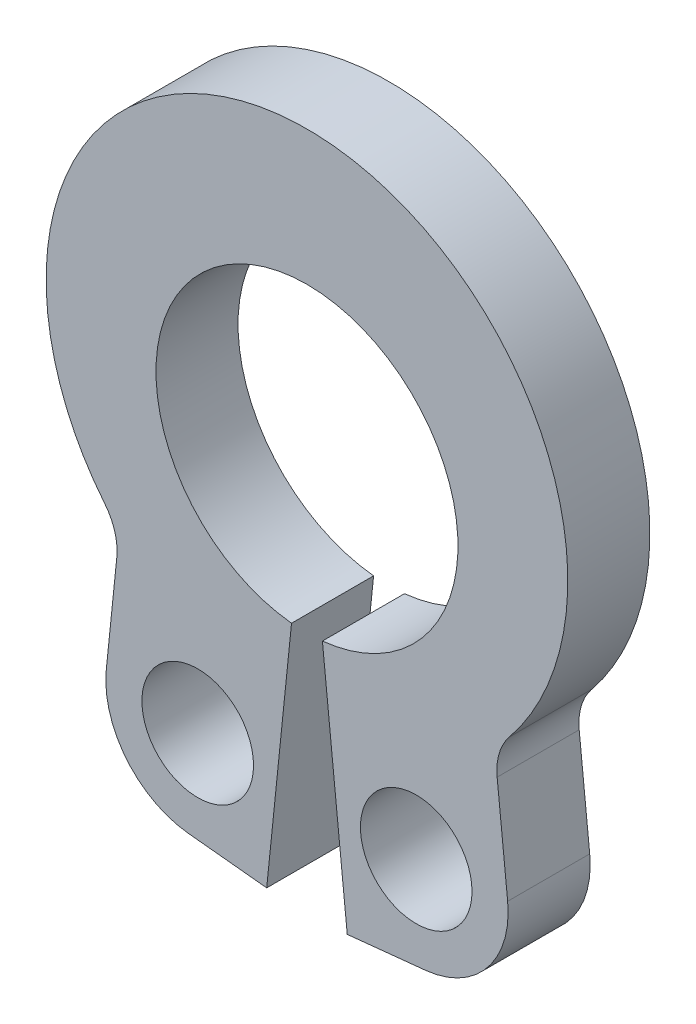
ISO-10303-21;
HEADER;
FILE_DESCRIPTION(('STEP AP214'),'2;1');
FILE_NAME('part.step','',(''),(''),'','','');
FILE_SCHEMA(('AUTOMOTIVE_DESIGN { 1 0 10303 214 1 1 1 1 }'));
ENDSEC;
DATA;
#1=APPLICATION_CONTEXT('core data for automotive mechanical design processes');
#2=APPLICATION_PROTOCOL_DEFINITION('international standard','automotive_design',2000,#1);
#3=PRODUCT_CONTEXT('',#1,'mechanical');
#4=PRODUCT('Part','Part','',(#3));
#5=PRODUCT_RELATED_PRODUCT_CATEGORY('part','',(#4));
#6=PRODUCT_DEFINITION_FORMATION('','',#4);
#7=PRODUCT_DEFINITION_CONTEXT('part definition',#1,'design');
#8=PRODUCT_DEFINITION('design','',#6,#7);
#9=PRODUCT_DEFINITION_SHAPE('','',#8);
#10=(LENGTH_UNIT() NAMED_UNIT(*) SI_UNIT(.MILLI.,.METRE.));
#11=(NAMED_UNIT(*) PLANE_ANGLE_UNIT() SI_UNIT($,.RADIAN.));
#12=(NAMED_UNIT(*) SI_UNIT($,.STERADIAN.) SOLID_ANGLE_UNIT());
#13=UNCERTAINTY_MEASURE_WITH_UNIT(LENGTH_MEASURE(1.E-05),#10,'distance_accuracy_value','');
#14=(GEOMETRIC_REPRESENTATION_CONTEXT(3) GLOBAL_UNCERTAINTY_ASSIGNED_CONTEXT((#13)) GLOBAL_UNIT_ASSIGNED_CONTEXT((#10,
#11,#12)) REPRESENTATION_CONTEXT('',''));
#15=CARTESIAN_POINT('',(0.,0.,0.));
#16=DIRECTION('',(0.,0.,1.));
#17=DIRECTION('',(1.,0.,0.));
#18=AXIS2_PLACEMENT_3D('',#15,#16,#17);
#19=CARTESIAN_POINT('',(0.,0.,-0.635));
#20=DIRECTION('',(0.,0.,1.));
#21=DIRECTION('',(1.,0.,0.));
#22=AXIS2_PLACEMENT_3D('',#19,#20,#21);
#23=CYLINDRICAL_SURFACE('',#22,1.1684);
#24=CARTESIAN_POINT('',(0.,0.,0.));
#25=DIRECTION('',(0.,0.,-1.));
#26=DIRECTION('',(1.,0.,0.));
#27=AXIS2_PLACEMENT_3D('',#24,#25,#26);
#28=CIRCLE('',#27,1.1684);
#29=CARTESIAN_POINT('',(-0.119485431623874,-1.1622744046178,0.));
#30=VERTEX_POINT('',#29);
#31=CARTESIAN_POINT('',(0.119485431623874,-1.1622744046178,0.));
#32=VERTEX_POINT('',#31);
#33=EDGE_CURVE('E154',#30,#32,#28,.T.);
#34=ORIENTED_EDGE('',*,*,#33,.F.);
#35=DIRECTION('',(0.,0.,1.));
#36=VECTOR('',#35,1.);
#37=CARTESIAN_POINT('',(-0.119485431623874,-1.1622744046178,-0.635));
#38=LINE('',#37,#36);
#39=CARTESIAN_POINT('',(-0.119485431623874,-1.1622744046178,-0.635));
#40=VERTEX_POINT('',#39);
#41=EDGE_CURVE('E11',#40,#30,#38,.T.);
#42=ORIENTED_EDGE('',*,*,#41,.F.);
#43=CARTESIAN_POINT('',(0.,0.,-0.635));
#44=DIRECTION('',(0.,0.,-1.));
#45=DIRECTION('',(1.,0.,0.));
#46=AXIS2_PLACEMENT_3D('',#43,#44,#45);
#47=CIRCLE('',#46,1.1684);
#48=CARTESIAN_POINT('',(0.119485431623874,-1.1622744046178,-0.635));
#49=VERTEX_POINT('',#48);
#50=EDGE_CURVE('E187',#40,#49,#47,.T.);
#51=ORIENTED_EDGE('',*,*,#50,.T.);
#52=DIRECTION('',(0.,0.,1.));
#53=VECTOR('',#52,1.);
#54=CARTESIAN_POINT('',(0.119485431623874,-1.1622744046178,-0.635));
#55=LINE('',#54,#53);
#56=EDGE_CURVE('E36',#49,#32,#55,.T.);
#57=ORIENTED_EDGE('',*,*,#56,.T.);
#58=EDGE_LOOP('',(#34,#42,#51,#57));
#59=FACE_BOUND('',#58,.T.);
#60=ADVANCED_FACE('F33',(#59),#23,.F.);
#61=CARTESIAN_POINT('',(-0.119485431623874,-1.1622744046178,-0.635));
#62=DIRECTION('',(0.994757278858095,-0.102264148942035,0.));
#63=DIRECTION('',(0.102264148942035,0.994757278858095,0.));
#64=AXIS2_PLACEMENT_3D('',#61,#62,#63);
#65=PLANE('',#64);
#66=DIRECTION('',(0.102264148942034,0.994757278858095,0.));
#67=VECTOR('',#66,1.);
#68=CARTESIAN_POINT('',(-0.119485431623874,-1.1622744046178,0.));
#69=LINE('',#68,#67);
#70=CARTESIAN_POINT('',(-0.311701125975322,-3.03202018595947,0.));
#71=VERTEX_POINT('',#70);
#72=EDGE_CURVE('E185',#71,#30,#69,.T.);
#73=ORIENTED_EDGE('',*,*,#72,.F.);
#74=DIRECTION('',(0.,0.,1.));
#75=VECTOR('',#74,1.);
#76=CARTESIAN_POINT('',(-0.311701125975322,-3.03202018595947,-0.635));
#77=LINE('',#76,#75);
#78=CARTESIAN_POINT('',(-0.311701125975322,-3.03202018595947,-0.635));
#79=VERTEX_POINT('',#78);
#80=EDGE_CURVE('E42',#79,#71,#77,.T.);
#81=ORIENTED_EDGE('',*,*,#80,.F.);
#82=DIRECTION('',(0.102264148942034,0.994757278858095,0.));
#83=VECTOR('',#82,1.);
#84=CARTESIAN_POINT('',(-0.119485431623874,-1.1622744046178,-0.635));
#85=LINE('',#84,#83);
#86=EDGE_CURVE('E144',#79,#40,#85,.T.);
#87=ORIENTED_EDGE('',*,*,#86,.T.);
#88=ORIENTED_EDGE('',*,*,#41,.T.);
#89=EDGE_LOOP('',(#73,#81,#87,#88));
#90=FACE_BOUND('',#89,.T.);
#91=ADVANCED_FACE('F207',(#90),#65,.T.);
#92=CARTESIAN_POINT('',(-0.311701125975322,-3.03202018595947,-0.635));
#93=DIRECTION('',(-0.102264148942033,-0.994757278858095,0.));
#94=DIRECTION('',(0.994757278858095,-0.102264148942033,0.));
#95=AXIS2_PLACEMENT_3D('',#92,#93,#94);
#96=PLANE('',#95);
#97=DIRECTION('',(0.994757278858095,-0.102264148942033,0.));
#98=VECTOR('',#97,1.);
#99=CARTESIAN_POINT('',(-0.311701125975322,-3.03202018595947,0.));
#100=LINE('',#99,#98);
#101=CARTESIAN_POINT('',(-0.918105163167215,-2.96967996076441,0.));
#102=VERTEX_POINT('',#101);
#103=EDGE_CURVE('E131',#102,#71,#100,.T.);
#104=ORIENTED_EDGE('',*,*,#103,.F.);
#105=DIRECTION('',(0.,0.,1.));
#106=VECTOR('',#105,1.);
#107=CARTESIAN_POINT('',(-0.918105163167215,-2.96967996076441,-0.635));
#108=LINE('',#107,#106);
#109=CARTESIAN_POINT('',(-0.918105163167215,-2.96967996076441,-0.635));
#110=VERTEX_POINT('',#109);
#111=EDGE_CURVE('E126',#110,#102,#108,.T.);
#112=ORIENTED_EDGE('',*,*,#111,.F.);
#113=DIRECTION('',(0.994757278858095,-0.102264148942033,0.));
#114=VECTOR('',#113,1.);
#115=CARTESIAN_POINT('',(-0.311701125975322,-3.03202018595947,-0.635));
#116=LINE('',#115,#114);
#117=EDGE_CURVE('E129',#110,#79,#116,.T.);
#118=ORIENTED_EDGE('',*,*,#117,.T.);
#119=ORIENTED_EDGE('',*,*,#80,.T.);
#120=EDGE_LOOP('',(#104,#112,#118,#119));
#121=FACE_BOUND('',#120,.T.);
#122=ADVANCED_FACE('F128',(#121),#96,.T.);
#123=CARTESIAN_POINT('',(-0.84537490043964,-2.26220858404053,-0.635));
#124=DIRECTION('',(0.,0.,1.));
#125=DIRECTION('',(1.,0.,0.));
#126=AXIS2_PLACEMENT_3D('',#123,#124,#125);
#127=CYLINDRICAL_SURFACE('',#126,0.7112);
#128=CARTESIAN_POINT('',(-0.84537490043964,-2.26220858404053,0.));
#129=DIRECTION('',(0.,0.,1.));
#130=DIRECTION('',(1.,0.,0.));
#131=AXIS2_PLACEMENT_3D('',#128,#129,#130);
#132=CIRCLE('',#131,0.7112);
#133=CARTESIAN_POINT('',(-1.55284627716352,-2.18947832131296,0.));
#134=VERTEX_POINT('',#133);
#135=EDGE_CURVE('E182',#134,#102,#132,.T.);
#136=ORIENTED_EDGE('',*,*,#135,.F.);
#137=DIRECTION('',(0.,0.,1.));
#138=VECTOR('',#137,1.);
#139=CARTESIAN_POINT('',(-1.55284627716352,-2.18947832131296,-0.635));
#140=LINE('',#139,#138);
#141=CARTESIAN_POINT('',(-1.55284627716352,-2.18947832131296,-0.635));
#142=VERTEX_POINT('',#141);
#143=EDGE_CURVE('E136',#142,#134,#140,.T.);
#144=ORIENTED_EDGE('',*,*,#143,.F.);
#145=CARTESIAN_POINT('',(-0.84537490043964,-2.26220858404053,-0.635));
#146=DIRECTION('',(0.,0.,1.));
#147=DIRECTION('',(1.,0.,0.));
#148=AXIS2_PLACEMENT_3D('',#145,#146,#147);
#149=CIRCLE('',#148,0.7112);
#150=EDGE_CURVE('E142',#142,#110,#149,.T.);
#151=ORIENTED_EDGE('',*,*,#150,.T.);
#152=ORIENTED_EDGE('',*,*,#111,.T.);
#153=EDGE_LOOP('',(#136,#144,#151,#152));
#154=FACE_BOUND('',#153,.T.);
#155=ADVANCED_FACE('F146',(#154),#127,.T.);
#156=CARTESIAN_POINT('',(-1.47150915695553,-1.39828518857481,-0.635));
#157=DIRECTION('',(-0.994757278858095,0.102264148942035,0.));
#158=DIRECTION('',(-0.102264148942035,-0.994757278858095,0.));
#159=AXIS2_PLACEMENT_3D('',#156,#157,#158);
#160=PLANE('',#159);
#161=DIRECTION('',(-0.102264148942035,-0.994757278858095,0.));
#162=VECTOR('',#161,1.);
#163=CARTESIAN_POINT('',(-1.47150915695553,-1.39828518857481,0.));
#164=LINE('',#163,#162);
#165=CARTESIAN_POINT('',(-1.47150915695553,-1.39828518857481,0.));
#166=VERTEX_POINT('',#165);
#167=EDGE_CURVE('E179',#166,#134,#164,.T.);
#168=ORIENTED_EDGE('',*,*,#167,.F.);
#169=DIRECTION('',(0.,0.,1.));
#170=VECTOR('',#169,1.);
#171=CARTESIAN_POINT('',(-1.47150915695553,-1.39828518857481,-0.635));
#172=LINE('',#171,#170);
#173=CARTESIAN_POINT('',(-1.47150915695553,-1.39828518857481,-0.635));
#174=VERTEX_POINT('',#173);
#175=EDGE_CURVE('E191',#174,#166,#172,.T.);
#176=ORIENTED_EDGE('',*,*,#175,.F.);
#177=DIRECTION('',(-0.102264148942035,-0.994757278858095,0.));
#178=VECTOR('',#177,1.);
#179=CARTESIAN_POINT('',(-1.47150915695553,-1.39828518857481,-0.635));
#180=LINE('',#179,#178);
#181=EDGE_CURVE('E147',#174,#142,#180,.T.);
#182=ORIENTED_EDGE('',*,*,#181,.T.);
#183=ORIENTED_EDGE('',*,*,#143,.T.);
#184=EDGE_LOOP('',(#168,#176,#182,#183));
#185=FACE_BOUND('',#184,.T.);
#186=ADVANCED_FACE('F220',(#185),#160,.T.);
#187=CARTESIAN_POINT('',(-1.90104534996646,-1.35412752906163,-0.635));
#188=DIRECTION('',(0.,0.,1.));
#189=DIRECTION('',(1.,0.,0.));
#190=AXIS2_PLACEMENT_3D('',#187,#188,#189);
#191=CYLINDRICAL_SURFACE('',#190,0.4318);
#192=CARTESIAN_POINT('',(-1.90104534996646,-1.35412752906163,0.));
#193=DIRECTION('',(0.,0.,-1.));
#194=DIRECTION('',(1.,0.,0.));
#195=AXIS2_PLACEMENT_3D('',#192,#193,#194);
#196=CIRCLE('',#195,0.4318);
#197=CARTESIAN_POINT('',(-1.56600858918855,-1.08172780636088,0.));
#198=VERTEX_POINT('',#197);
#199=EDGE_CURVE('E176',#198,#166,#196,.T.);
#200=ORIENTED_EDGE('',*,*,#199,.F.);
#201=DIRECTION('',(0.,0.,1.));
#202=VECTOR('',#201,1.);
#203=CARTESIAN_POINT('',(-1.56600858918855,-1.08172780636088,-0.635));
#204=LINE('',#203,#202);
#205=CARTESIAN_POINT('',(-1.56600858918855,-1.08172780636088,-0.635));
#206=VERTEX_POINT('',#205);
#207=EDGE_CURVE('E193',#206,#198,#204,.T.);
#208=ORIENTED_EDGE('',*,*,#207,.F.);
#209=CARTESIAN_POINT('',(-1.90104534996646,-1.35412752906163,-0.635));
#210=DIRECTION('',(0.,0.,-1.));
#211=DIRECTION('',(1.,0.,0.));
#212=AXIS2_PLACEMENT_3D('',#209,#210,#211);
#213=CIRCLE('',#212,0.4318);
#214=EDGE_CURVE('E149',#206,#174,#213,.T.);
#215=ORIENTED_EDGE('',*,*,#214,.T.);
#216=ORIENTED_EDGE('',*,*,#175,.T.);
#217=EDGE_LOOP('',(#200,#208,#215,#216));
#218=FACE_BOUND('',#217,.T.);
#219=ADVANCED_FACE('F223',(#218),#191,.F.);
#220=CARTESIAN_POINT('',(0.,0.191506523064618,-0.635));
#221=DIRECTION('',(0.,0.,1.));
#222=DIRECTION('',(1.,0.,0.));
#223=AXIS2_PLACEMENT_3D('',#220,#221,#222);
#224=CYLINDRICAL_SURFACE('',#223,2.01829347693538);
#225=CARTESIAN_POINT('',(0.,0.191506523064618,0.));
#226=DIRECTION('',(0.,0.,1.));
#227=DIRECTION('',(1.,0.,0.));
#228=AXIS2_PLACEMENT_3D('',#225,#226,#227);
#229=CIRCLE('',#228,2.01829347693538);
#230=CARTESIAN_POINT('',(1.56600858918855,-1.08172780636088,0.));
#231=VERTEX_POINT('',#230);
#232=EDGE_CURVE('E173',#231,#198,#229,.T.);
#233=ORIENTED_EDGE('',*,*,#232,.F.);
#234=DIRECTION('',(0.,0.,1.));
#235=VECTOR('',#234,1.);
#236=CARTESIAN_POINT('',(1.56600858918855,-1.08172780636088,-0.635));
#237=LINE('',#236,#235);
#238=CARTESIAN_POINT('',(1.56600858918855,-1.08172780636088,-0.635));
#239=VERTEX_POINT('',#238);
#240=EDGE_CURVE('E195',#239,#231,#237,.T.);
#241=ORIENTED_EDGE('',*,*,#240,.F.);
#242=CARTESIAN_POINT('',(0.,0.191506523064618,-0.635));
#243=DIRECTION('',(0.,0.,1.));
#244=DIRECTION('',(1.,0.,0.));
#245=AXIS2_PLACEMENT_3D('',#242,#243,#244);
#246=CIRCLE('',#245,2.01829347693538);
#247=EDGE_CURVE('E297',#239,#206,#246,.T.);
#248=ORIENTED_EDGE('',*,*,#247,.T.);
#249=ORIENTED_EDGE('',*,*,#207,.T.);
#250=EDGE_LOOP('',(#233,#241,#248,#249));
#251=FACE_BOUND('',#250,.T.);
#252=ADVANCED_FACE('F227',(#251),#224,.T.);
#253=CARTESIAN_POINT('',(1.90104534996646,-1.35412752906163,-0.635));
#254=DIRECTION('',(0.,0.,1.));
#255=DIRECTION('',(1.,0.,0.));
#256=AXIS2_PLACEMENT_3D('',#253,#254,#255);
#257=CYLINDRICAL_SURFACE('',#256,0.4318);
#258=CARTESIAN_POINT('',(1.90104534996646,-1.35412752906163,0.));
#259=DIRECTION('',(0.,0.,-1.));
#260=DIRECTION('',(1.,0.,0.));
#261=AXIS2_PLACEMENT_3D('',#258,#259,#260);
#262=CIRCLE('',#261,0.4318);
#263=CARTESIAN_POINT('',(1.47150915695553,-1.39828518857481,0.));
#264=VERTEX_POINT('',#263);
#265=EDGE_CURVE('E170',#264,#231,#262,.T.);
#266=ORIENTED_EDGE('',*,*,#265,.F.);
#267=DIRECTION('',(0.,0.,1.));
#268=VECTOR('',#267,1.);
#269=CARTESIAN_POINT('',(1.47150915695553,-1.39828518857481,-0.635));
#270=LINE('',#269,#268);
#271=CARTESIAN_POINT('',(1.47150915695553,-1.39828518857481,-0.635));
#272=VERTEX_POINT('',#271);
#273=EDGE_CURVE('E197',#272,#264,#270,.T.);
#274=ORIENTED_EDGE('',*,*,#273,.F.);
#275=CARTESIAN_POINT('',(1.90104534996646,-1.35412752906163,-0.635));
#276=DIRECTION('',(0.,0.,-1.));
#277=DIRECTION('',(1.,0.,0.));
#278=AXIS2_PLACEMENT_3D('',#275,#276,#277);
#279=CIRCLE('',#278,0.4318);
#280=EDGE_CURVE('E294',#272,#239,#279,.T.);
#281=ORIENTED_EDGE('',*,*,#280,.T.);
#282=ORIENTED_EDGE('',*,*,#240,.T.);
#283=EDGE_LOOP('',(#266,#274,#281,#282));
#284=FACE_BOUND('',#283,.T.);
#285=ADVANCED_FACE('F231',(#284),#257,.F.);
#286=CARTESIAN_POINT('',(1.47150915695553,-1.39828518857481,-0.635));
#287=DIRECTION('',(0.994757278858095,0.102264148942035,0.));
#288=DIRECTION('',(-0.102264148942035,0.994757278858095,0.));
#289=AXIS2_PLACEMENT_3D('',#286,#287,#288);
#290=PLANE('',#289);
#291=DIRECTION('',(-0.102264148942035,0.994757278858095,0.));
#292=VECTOR('',#291,1.);
#293=CARTESIAN_POINT('',(1.47150915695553,-1.39828518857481,0.));
#294=LINE('',#293,#292);
#295=CARTESIAN_POINT('',(1.55284627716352,-2.18947832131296,0.));
#296=VERTEX_POINT('',#295);
#297=EDGE_CURVE('E167',#296,#264,#294,.T.);
#298=ORIENTED_EDGE('',*,*,#297,.F.);
#299=DIRECTION('',(0.,0.,1.));
#300=VECTOR('',#299,1.);
#301=CARTESIAN_POINT('',(1.55284627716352,-2.18947832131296,-0.635));
#302=LINE('',#301,#300);
#303=CARTESIAN_POINT('',(1.55284627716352,-2.18947832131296,-0.635));
#304=VERTEX_POINT('',#303);
#305=EDGE_CURVE('E199',#304,#296,#302,.T.);
#306=ORIENTED_EDGE('',*,*,#305,.F.);
#307=DIRECTION('',(-0.102264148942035,0.994757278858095,0.));
#308=VECTOR('',#307,1.);
#309=CARTESIAN_POINT('',(1.47150915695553,-1.39828518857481,-0.635));
#310=LINE('',#309,#308);
#311=EDGE_CURVE('E291',#304,#272,#310,.T.);
#312=ORIENTED_EDGE('',*,*,#311,.T.);
#313=ORIENTED_EDGE('',*,*,#273,.T.);
#314=EDGE_LOOP('',(#298,#306,#312,#313));
#315=FACE_BOUND('',#314,.T.);
#316=ADVANCED_FACE('F235',(#315),#290,.T.);
#317=CARTESIAN_POINT('',(0.84537490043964,-2.26220858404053,-0.635));
#318=DIRECTION('',(0.,0.,1.));
#319=DIRECTION('',(1.,0.,0.));
#320=AXIS2_PLACEMENT_3D('',#317,#318,#319);
#321=CYLINDRICAL_SURFACE('',#320,0.7112);
#322=CARTESIAN_POINT('',(0.84537490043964,-2.26220858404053,0.));
#323=DIRECTION('',(0.,0.,1.));
#324=DIRECTION('',(1.,0.,0.));
#325=AXIS2_PLACEMENT_3D('',#322,#323,#324);
#326=CIRCLE('',#325,0.7112);
#327=CARTESIAN_POINT('',(0.918105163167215,-2.96967996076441,0.));
#328=VERTEX_POINT('',#327);
#329=EDGE_CURVE('E164',#328,#296,#326,.T.);
#330=ORIENTED_EDGE('',*,*,#329,.F.);
#331=DIRECTION('',(0.,0.,1.));
#332=VECTOR('',#331,1.);
#333=CARTESIAN_POINT('',(0.918105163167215,-2.96967996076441,-0.635));
#334=LINE('',#333,#332);
#335=CARTESIAN_POINT('',(0.918105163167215,-2.96967996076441,-0.635));
#336=VERTEX_POINT('',#335);
#337=EDGE_CURVE('E201',#336,#328,#334,.T.);
#338=ORIENTED_EDGE('',*,*,#337,.F.);
#339=CARTESIAN_POINT('',(0.84537490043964,-2.26220858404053,-0.635));
#340=DIRECTION('',(0.,0.,1.));
#341=DIRECTION('',(1.,0.,0.));
#342=AXIS2_PLACEMENT_3D('',#339,#340,#341);
#343=CIRCLE('',#342,0.7112);
#344=EDGE_CURVE('E288',#336,#304,#343,.T.);
#345=ORIENTED_EDGE('',*,*,#344,.T.);
#346=ORIENTED_EDGE('',*,*,#305,.T.);
#347=EDGE_LOOP('',(#330,#338,#345,#346));
#348=FACE_BOUND('',#347,.T.);
#349=ADVANCED_FACE('F239',(#348),#321,.T.);
#350=CARTESIAN_POINT('',(0.311701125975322,-3.03202018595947,-0.635));
#351=DIRECTION('',(0.102264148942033,-0.994757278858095,0.));
#352=DIRECTION('',(0.994757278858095,0.102264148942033,0.));
#353=AXIS2_PLACEMENT_3D('',#350,#351,#352);
#354=PLANE('',#353);
#355=DIRECTION('',(0.994757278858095,0.102264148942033,0.));
#356=VECTOR('',#355,1.);
#357=CARTESIAN_POINT('',(0.311701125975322,-3.03202018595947,0.));
#358=LINE('',#357,#356);
#359=CARTESIAN_POINT('',(0.311701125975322,-3.03202018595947,0.));
#360=VERTEX_POINT('',#359);
#361=EDGE_CURVE('E161',#360,#328,#358,.T.);
#362=ORIENTED_EDGE('',*,*,#361,.F.);
#363=DIRECTION('',(0.,0.,1.));
#364=VECTOR('',#363,1.);
#365=CARTESIAN_POINT('',(0.311701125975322,-3.03202018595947,-0.635));
#366=LINE('',#365,#364);
#367=CARTESIAN_POINT('',(0.311701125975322,-3.03202018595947,-0.635));
#368=VERTEX_POINT('',#367);
#369=EDGE_CURVE('E202',#368,#360,#366,.T.);
#370=ORIENTED_EDGE('',*,*,#369,.F.);
#371=DIRECTION('',(0.994757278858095,0.102264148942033,0.));
#372=VECTOR('',#371,1.);
#373=CARTESIAN_POINT('',(0.311701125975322,-3.03202018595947,-0.635));
#374=LINE('',#373,#372);
#375=EDGE_CURVE('E285',#368,#336,#374,.T.);
#376=ORIENTED_EDGE('',*,*,#375,.T.);
#377=ORIENTED_EDGE('',*,*,#337,.T.);
#378=EDGE_LOOP('',(#362,#370,#376,#377));
#379=FACE_BOUND('',#378,.T.);
#380=ADVANCED_FACE('F243',(#379),#354,.T.);
#381=CARTESIAN_POINT('',(0.119485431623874,-1.1622744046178,-0.635));
#382=DIRECTION('',(-0.994757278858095,-0.102264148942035,0.));
#383=DIRECTION('',(0.102264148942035,-0.994757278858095,0.));
#384=AXIS2_PLACEMENT_3D('',#381,#382,#383);
#385=PLANE('',#384);
#386=DIRECTION('',(0.102264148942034,-0.994757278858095,0.));
#387=VECTOR('',#386,1.);
#388=CARTESIAN_POINT('',(0.119485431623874,-1.1622744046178,0.));
#389=LINE('',#388,#387);
#390=EDGE_CURVE('E157',#32,#360,#389,.T.);
#391=ORIENTED_EDGE('',*,*,#390,.F.);
#392=ORIENTED_EDGE('',*,*,#56,.F.);
#393=DIRECTION('',(0.102264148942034,-0.994757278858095,0.));
#394=VECTOR('',#393,1.);
#395=CARTESIAN_POINT('',(0.119485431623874,-1.1622744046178,-0.635));
#396=LINE('',#395,#394);
#397=EDGE_CURVE('E283',#49,#368,#396,.T.);
#398=ORIENTED_EDGE('',*,*,#397,.T.);
#399=ORIENTED_EDGE('',*,*,#369,.T.);
#400=EDGE_LOOP('',(#391,#392,#398,#399));
#401=FACE_BOUND('',#400,.T.);
#402=ADVANCED_FACE('F204',(#401),#385,.T.);
#403=CARTESIAN_POINT('',(0.,0.,-0.635));
#404=DIRECTION('',(0.,0.,1.));
#405=DIRECTION('',(1.,0.,0.));
#406=AXIS2_PLACEMENT_3D('',#403,#404,#405);
#407=PLANE('',#406);
#408=CARTESIAN_POINT('',(-0.845374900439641,-2.26220858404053,-0.635));
#409=DIRECTION('',(0.,0.,1.));
#410=DIRECTION('',(1.,0.,0.));
#411=AXIS2_PLACEMENT_3D('',#408,#409,#410);
#412=CIRCLE('',#411,0.4318);
#413=CARTESIAN_POINT('',(-0.413574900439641,-2.26220858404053,-0.635));
#414=VERTEX_POINT('',#413);
#415=EDGE_CURVE('E270',#414,#414,#412,.T.);
#416=ORIENTED_EDGE('',*,*,#415,.T.);
#417=EDGE_LOOP('',(#416));
#418=FACE_BOUND('',#417,.T.);
#419=CARTESIAN_POINT('',(0.845374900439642,-2.26220858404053,-0.635));
#420=DIRECTION('',(0.,0.,1.));
#421=DIRECTION('',(1.,0.,0.));
#422=AXIS2_PLACEMENT_3D('',#419,#420,#421);
#423=CIRCLE('',#422,0.4318);
#424=CARTESIAN_POINT('',(1.27717490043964,-2.26220858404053,-0.635));
#425=VERTEX_POINT('',#424);
#426=EDGE_CURVE('E158',#425,#425,#423,.T.);
#427=ORIENTED_EDGE('',*,*,#426,.T.);
#428=EDGE_LOOP('',(#427));
#429=FACE_BOUND('',#428,.T.);
#430=ORIENTED_EDGE('',*,*,#50,.F.);
#431=ORIENTED_EDGE('',*,*,#86,.F.);
#432=ORIENTED_EDGE('',*,*,#117,.F.);
#433=ORIENTED_EDGE('',*,*,#150,.F.);
#434=ORIENTED_EDGE('',*,*,#181,.F.);
#435=ORIENTED_EDGE('',*,*,#214,.F.);
#436=ORIENTED_EDGE('',*,*,#247,.F.);
#437=ORIENTED_EDGE('',*,*,#280,.F.);
#438=ORIENTED_EDGE('',*,*,#311,.F.);
#439=ORIENTED_EDGE('',*,*,#344,.F.);
#440=ORIENTED_EDGE('',*,*,#375,.F.);
#441=ORIENTED_EDGE('',*,*,#397,.F.);
#442=EDGE_LOOP('',(#430,#431,#432,#433,#434,#435,#436,#437,#438,#439,#440,#441));
#443=FACE_BOUND('',#442,.T.);
#444=ADVANCED_FACE('F140',(#418,#429,#443),#407,.F.);
#445=CARTESIAN_POINT('',(0.,0.,0.));
#446=DIRECTION('',(0.,0.,1.));
#447=DIRECTION('',(1.,0.,0.));
#448=AXIS2_PLACEMENT_3D('',#445,#446,#447);
#449=PLANE('',#448);
#450=CARTESIAN_POINT('',(-0.845374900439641,-2.26220858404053,0.));
#451=DIRECTION('',(0.,0.,1.));
#452=DIRECTION('',(1.,0.,0.));
#453=AXIS2_PLACEMENT_3D('',#450,#451,#452);
#454=CIRCLE('',#453,0.4318);
#455=CARTESIAN_POINT('',(-0.413574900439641,-2.26220858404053,0.));
#456=VERTEX_POINT('',#455);
#457=EDGE_CURVE('E273',#456,#456,#454,.T.);
#458=ORIENTED_EDGE('',*,*,#457,.F.);
#459=EDGE_LOOP('',(#458));
#460=FACE_BOUND('',#459,.T.);
#461=CARTESIAN_POINT('',(0.845374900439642,-2.26220858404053,0.));
#462=DIRECTION('',(0.,0.,1.));
#463=DIRECTION('',(1.,0.,0.));
#464=AXIS2_PLACEMENT_3D('',#461,#462,#463);
#465=CIRCLE('',#464,0.4318);
#466=CARTESIAN_POINT('',(1.27717490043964,-2.26220858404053,0.));
#467=VERTEX_POINT('',#466);
#468=EDGE_CURVE('E275',#467,#467,#465,.T.);
#469=ORIENTED_EDGE('',*,*,#468,.F.);
#470=EDGE_LOOP('',(#469));
#471=FACE_BOUND('',#470,.T.);
#472=ORIENTED_EDGE('',*,*,#33,.T.);
#473=ORIENTED_EDGE('',*,*,#390,.T.);
#474=ORIENTED_EDGE('',*,*,#361,.T.);
#475=ORIENTED_EDGE('',*,*,#329,.T.);
#476=ORIENTED_EDGE('',*,*,#297,.T.);
#477=ORIENTED_EDGE('',*,*,#265,.T.);
#478=ORIENTED_EDGE('',*,*,#232,.T.);
#479=ORIENTED_EDGE('',*,*,#199,.T.);
#480=ORIENTED_EDGE('',*,*,#167,.T.);
#481=ORIENTED_EDGE('',*,*,#135,.T.);
#482=ORIENTED_EDGE('',*,*,#103,.T.);
#483=ORIENTED_EDGE('',*,*,#72,.T.);
#484=EDGE_LOOP('',(#472,#473,#474,#475,#476,#477,#478,#479,#480,#481,#482,#483));
#485=FACE_BOUND('',#484,.T.);
#486=ADVANCED_FACE('F206',(#460,#471,#485),#449,.T.);
#487=CARTESIAN_POINT('',(0.845374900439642,-2.26220858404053,-0.635));
#488=DIRECTION('',(0.,0.,1.));
#489=DIRECTION('',(1.,0.,0.));
#490=AXIS2_PLACEMENT_3D('',#487,#488,#489);
#491=CYLINDRICAL_SURFACE('',#490,0.4318);
#492=ORIENTED_EDGE('',*,*,#426,.F.);
#493=EDGE_LOOP('',(#492));
#494=FACE_BOUND('',#493,.T.);
#495=ORIENTED_EDGE('',*,*,#468,.T.);
#496=EDGE_LOOP('',(#495));
#497=FACE_BOUND('',#496,.T.);
#498=ADVANCED_FACE('F255',(#494,#497),#491,.F.);
#499=CARTESIAN_POINT('',(-0.845374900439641,-2.26220858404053,-0.635));
#500=DIRECTION('',(0.,0.,1.));
#501=DIRECTION('',(1.,0.,0.));
#502=AXIS2_PLACEMENT_3D('',#499,#500,#501);
#503=CYLINDRICAL_SURFACE('',#502,0.4318);
#504=ORIENTED_EDGE('',*,*,#415,.F.);
#505=EDGE_LOOP('',(#504));
#506=FACE_BOUND('',#505,.T.);
#507=ORIENTED_EDGE('',*,*,#457,.T.);
#508=EDGE_LOOP('',(#507));
#509=FACE_BOUND('',#508,.T.);
#510=ADVANCED_FACE('F262',(#506,#509),#503,.F.);
#511=CLOSED_SHELL('',(#60,#91,#122,#155,#186,#219,#252,#285,#316,#349,#380,#402,#444,#486,#498,#510));
#512=MANIFOLD_SOLID_BREP('B2',#511);
#513=ADVANCED_BREP_SHAPE_REPRESENTATION('',(#18,#512),#14);
#514=SHAPE_DEFINITION_REPRESENTATION(#9,#513);
ENDSEC;
END-ISO-10303-21;
